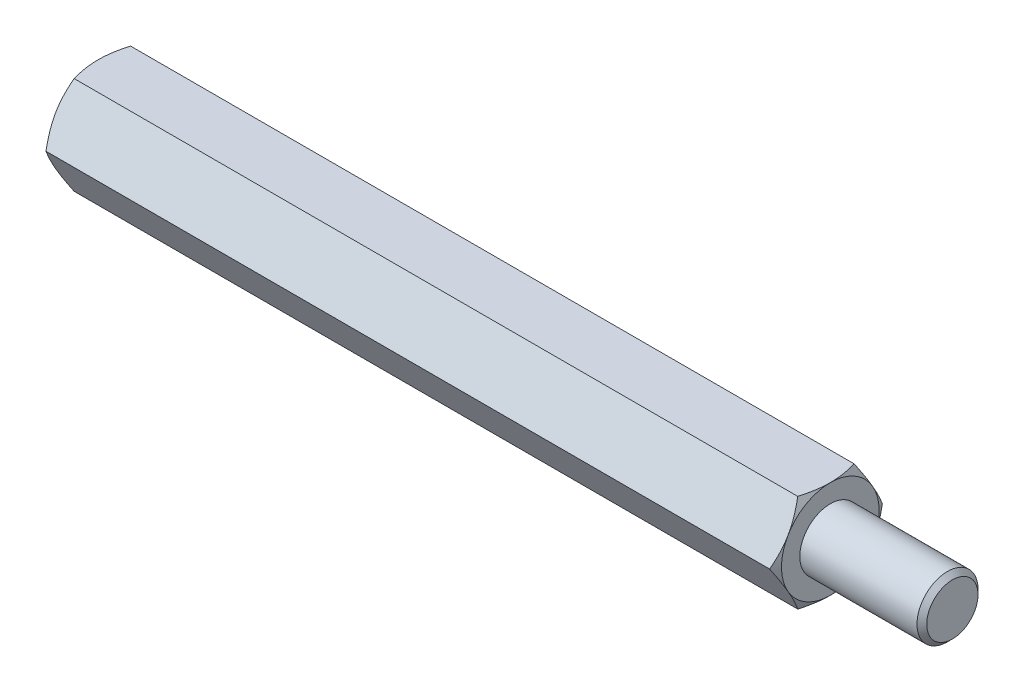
ISO-10303-21;
HEADER;
FILE_DESCRIPTION(('STEP AP214'),'2;1');
FILE_NAME('part.step','',(''),(''),'','','');
FILE_SCHEMA(('AUTOMOTIVE_DESIGN { 1 0 10303 214 1 1 1 1 }'));
ENDSEC;
DATA;
#1=APPLICATION_CONTEXT('core data for automotive mechanical design processes');
#2=APPLICATION_PROTOCOL_DEFINITION('international standard','automotive_design',2000,#1);
#3=PRODUCT_CONTEXT('',#1,'mechanical');
#4=PRODUCT('Part','Part','',(#3));
#5=PRODUCT_RELATED_PRODUCT_CATEGORY('part','',(#4));
#6=PRODUCT_DEFINITION_FORMATION('','',#4);
#7=PRODUCT_DEFINITION_CONTEXT('part definition',#1,'design');
#8=PRODUCT_DEFINITION('design','',#6,#7);
#9=PRODUCT_DEFINITION_SHAPE('','',#8);
#10=(LENGTH_UNIT() NAMED_UNIT(*) SI_UNIT(.MILLI.,.METRE.));
#11=(NAMED_UNIT(*) PLANE_ANGLE_UNIT() SI_UNIT($,.RADIAN.));
#12=(NAMED_UNIT(*) SI_UNIT($,.STERADIAN.) SOLID_ANGLE_UNIT());
#13=UNCERTAINTY_MEASURE_WITH_UNIT(LENGTH_MEASURE(1.E-05),#10,'distance_accuracy_value','');
#14=(GEOMETRIC_REPRESENTATION_CONTEXT(3) GLOBAL_UNCERTAINTY_ASSIGNED_CONTEXT((#13)) GLOBAL_UNIT_ASSIGNED_CONTEXT((#10,
#11,#12)) REPRESENTATION_CONTEXT('',''));
#15=CARTESIAN_POINT('',(0.,0.,0.));
#16=DIRECTION('',(0.,0.,1.));
#17=DIRECTION('',(1.,0.,0.));
#18=AXIS2_PLACEMENT_3D('',#15,#16,#17);
#19=CARTESIAN_POINT('',(30.,4.,-2.3094010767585));
#20=DIRECTION('',(1.,0.,0.));
#21=DIRECTION('',(0.,0.,-1.));
#22=AXIS2_PLACEMENT_3D('',#19,#20,#21);
#23=PLANE('',#22);
#24=CARTESIAN_POINT('',(30.,0.,0.));
#25=DIRECTION('',(1.,0.,0.));
#26=DIRECTION('',(0.,0.,-1.));
#27=AXIS2_PLACEMENT_3D('',#24,#25,#26);
#28=CIRCLE('',#27,4.00000000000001);
#29=CARTESIAN_POINT('',(30.,-2.00000000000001,-3.46410161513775));
#30=VERTEX_POINT('',#29);
#31=CARTESIAN_POINT('',(30.,2.,-3.46410161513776));
#32=VERTEX_POINT('',#31);
#33=EDGE_CURVE('E288',#30,#32,#28,.T.);
#34=ORIENTED_EDGE('',*,*,#33,.T.);
#35=CARTESIAN_POINT('',(30.,4.,0.));
#36=VERTEX_POINT('',#35);
#37=EDGE_CURVE('E53',#32,#36,#28,.T.);
#38=ORIENTED_EDGE('',*,*,#37,.T.);
#39=CARTESIAN_POINT('',(30.,2.,3.46410161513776));
#40=VERTEX_POINT('',#39);
#41=EDGE_CURVE('E296',#36,#40,#28,.T.);
#42=ORIENTED_EDGE('',*,*,#41,.T.);
#43=CARTESIAN_POINT('',(30.,-2.00000000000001,3.46410161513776));
#44=VERTEX_POINT('',#43);
#45=EDGE_CURVE('E301',#40,#44,#28,.T.);
#46=ORIENTED_EDGE('',*,*,#45,.T.);
#47=CARTESIAN_POINT('',(30.,0.,0.));
#48=DIRECTION('',(-1.,0.,0.));
#49=DIRECTION('',(0.,-1.,0.));
#50=AXIS2_PLACEMENT_3D('',#47,#48,#49);
#51=CIRCLE('',#50,4.);
#52=CARTESIAN_POINT('',(30.,-4.00000000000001,0.));
#53=VERTEX_POINT('',#52);
#54=EDGE_CURVE('E193',#53,#44,#51,.T.);
#55=ORIENTED_EDGE('',*,*,#54,.F.);
#56=EDGE_CURVE('E61',#53,#30,#28,.T.);
#57=ORIENTED_EDGE('',*,*,#56,.T.);
#58=EDGE_LOOP('',(#34,#38,#42,#46,#55,#57));
#59=FACE_BOUND('',#58,.T.);
#60=CARTESIAN_POINT('',(30.,0.,0.));
#61=DIRECTION('',(1.,0.,0.));
#62=DIRECTION('',(0.,0.,-1.));
#63=AXIS2_PLACEMENT_3D('',#60,#61,#62);
#64=CIRCLE('',#63,2.5);
#65=CARTESIAN_POINT('',(30.,0.,-2.5));
#66=VERTEX_POINT('',#65);
#67=EDGE_CURVE('E415',#66,#66,#64,.T.);
#68=ORIENTED_EDGE('',*,*,#67,.F.);
#69=EDGE_LOOP('',(#68));
#70=FACE_BOUND('',#69,.T.);
#71=ADVANCED_FACE('F37',(#59,#70),#23,.T.);
#72=CARTESIAN_POINT('',(30.,0.,-4.61880215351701));
#73=DIRECTION('',(0.,-0.5,0.866025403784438));
#74=DIRECTION('',(0.,-0.866025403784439,-0.5));
#75=AXIS2_PLACEMENT_3D('',#72,#73,#74);
#76=PLANE('',#75);
#77=CARTESIAN_POINT('',(29.6426677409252,-0.000200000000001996,-4.61891762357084));
#78=CARTESIAN_POINT('',(29.7012821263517,0.175579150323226,-4.5174314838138));
#79=CARTESIAN_POINT('',(29.7545896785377,0.352875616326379,-4.41506932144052));
#80=CARTESIAN_POINT('',(29.8476383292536,0.710538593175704,-4.20857250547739));
#81=CARTESIAN_POINT('',(29.8873465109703,0.890911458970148,-4.10443418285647));
#82=CARTESIAN_POINT('',(29.9491577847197,1.24942181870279,-3.89744813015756));
#83=CARTESIAN_POINT('',(29.9716722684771,1.42750415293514,-3.79463224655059));
#84=CARTESIAN_POINT('',(29.9985493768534,1.78450671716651,-3.58851671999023));
#85=CARTESIAN_POINT('',(30.0029342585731,1.9634256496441,-3.48521782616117));
#86=CARTESIAN_POINT('',(29.99380992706,2.29774284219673,-3.29219970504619));
#87=CARTESIAN_POINT('',(29.982541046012,2.45319115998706,-3.20245157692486));
#88=CARTESIAN_POINT('',(29.9468260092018,2.76307505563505,-3.02354002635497));
#89=CARTESIAN_POINT('',(29.9223676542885,2.91750956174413,-2.93437722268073));
#90=CARTESIAN_POINT('',(29.8612239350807,3.22803232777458,-2.75509682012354));
#91=CARTESIAN_POINT('',(29.8242793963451,3.3840812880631,-2.6650019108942));
#92=CARTESIAN_POINT('',(29.740429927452,3.69385183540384,-2.48615580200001));
#93=CARTESIAN_POINT('',(29.6935446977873,3.84757739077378,-2.39740231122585));
#94=CARTESIAN_POINT('',(29.6426677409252,4.0002,-2.30928560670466));
#95=B_SPLINE_CURVE_WITH_KNOTS('',3,(#77,#78,#79,#80,#81,#82,#83,#84,#85,#86,#87,#88,#89,#90,#91,
#92,#93,#94),.UNSPECIFIED.,.F.,.F.,(4,2,2,2,2,2,2,2,4),(0.,0.634047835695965,1.26961969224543,
1.88946157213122,2.50854226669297,3.04757825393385,3.58711366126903,4.13861653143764,
4.68903648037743),.UNSPECIFIED.);
#96=CARTESIAN_POINT('',(29.6427344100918,0.,-4.61880215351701));
#97=VERTEX_POINT('',#96);
#98=EDGE_CURVE('E329',#97,#32,#95,.T.);
#99=ORIENTED_EDGE('',*,*,#98,.F.);
#100=DIRECTION('',(-1.,0.,0.));
#101=VECTOR('',#100,1.);
#102=CARTESIAN_POINT('',(30.,0.,-4.61880215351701));
#103=LINE('',#102,#101);
#104=CARTESIAN_POINT('',(-29.6427344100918,0.,-4.61880215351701));
#105=VERTEX_POINT('',#104);
#106=EDGE_CURVE('E264',#97,#105,#103,.T.);
#107=ORIENTED_EDGE('',*,*,#106,.T.);
#108=CARTESIAN_POINT('',(-29.6426677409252,4.0002,-2.30928560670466));
#109=CARTESIAN_POINT('',(-29.7012821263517,3.82442084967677,-2.4107717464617));
#110=CARTESIAN_POINT('',(-29.7545896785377,3.64712438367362,-2.51313390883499));
#111=CARTESIAN_POINT('',(-29.8476383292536,3.28946140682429,-2.71963072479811));
#112=CARTESIAN_POINT('',(-29.8873465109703,3.10908854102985,-2.82376904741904));
#113=CARTESIAN_POINT('',(-29.9491577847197,2.75057818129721,-3.03075510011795));
#114=CARTESIAN_POINT('',(-29.9716722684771,2.57249584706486,-3.13357098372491));
#115=CARTESIAN_POINT('',(-29.9985493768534,2.21549328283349,-3.33968651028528));
#116=CARTESIAN_POINT('',(-30.0029342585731,2.0365743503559,-3.44298540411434));
#117=CARTESIAN_POINT('',(-29.99380992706,1.70225715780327,-3.63600352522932));
#118=CARTESIAN_POINT('',(-29.982541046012,1.54680884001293,-3.72575165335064));
#119=CARTESIAN_POINT('',(-29.9468260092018,1.23692494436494,-3.90466320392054));
#120=CARTESIAN_POINT('',(-29.9223676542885,1.08249043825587,-3.99382600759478));
#121=CARTESIAN_POINT('',(-29.8612239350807,0.771967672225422,-4.17310641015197));
#122=CARTESIAN_POINT('',(-29.8242793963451,0.615918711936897,-4.26320131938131));
#123=CARTESIAN_POINT('',(-29.740429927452,0.306148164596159,-4.4420474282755));
#124=CARTESIAN_POINT('',(-29.6935446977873,0.152422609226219,-4.53080091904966));
#125=CARTESIAN_POINT('',(-29.6426677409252,-0.000200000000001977,-4.61891762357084));
#126=B_SPLINE_CURVE_WITH_KNOTS('',3,(#108,#109,#110,#111,#112,#113,#114,#115,#116,#117,#118,
#119,#120,#121,#122,#123,#124,#125),.UNSPECIFIED.,.F.,.F.,(4,2,2,2,2,2,2,2,4),(0.,
0.634047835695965,1.26961969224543,1.88946157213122,2.50854226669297,3.04757825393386,
3.58711366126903,4.13861653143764,4.68903648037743),.UNSPECIFIED.);
#127=CARTESIAN_POINT('',(-30.,2.,-3.46410161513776));
#128=VERTEX_POINT('',#127);
#129=EDGE_CURVE('E316',#128,#105,#126,.T.);
#130=ORIENTED_EDGE('',*,*,#129,.F.);
#131=CARTESIAN_POINT('',(-29.6427344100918,4.,-2.3094010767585));
#132=VERTEX_POINT('',#131);
#133=EDGE_CURVE('E319',#132,#128,#126,.T.);
#134=ORIENTED_EDGE('',*,*,#133,.F.);
#135=DIRECTION('',(-1.,0.,0.));
#136=VECTOR('',#135,1.);
#137=CARTESIAN_POINT('',(30.,4.,-2.3094010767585));
#138=LINE('',#137,#136);
#139=CARTESIAN_POINT('',(29.642734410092,4.,-2.30940107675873));
#140=VERTEX_POINT('',#139);
#141=EDGE_CURVE('E279',#140,#132,#138,.T.);
#142=ORIENTED_EDGE('',*,*,#141,.F.);
#143=EDGE_CURVE('E229',#32,#140,#95,.T.);
#144=ORIENTED_EDGE('',*,*,#143,.F.);
#145=EDGE_LOOP('',(#99,#107,#130,#134,#142,#144));
#146=FACE_BOUND('',#145,.T.);
#147=ADVANCED_FACE('F148',(#146),#76,.F.);
#148=CARTESIAN_POINT('',(30.,4.,-2.3094010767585));
#149=DIRECTION('',(0.,-1.,0.));
#150=DIRECTION('',(0.,0.,-1.));
#151=AXIS2_PLACEMENT_3D('',#148,#149,#150);
#152=PLANE('',#151);
#153=CARTESIAN_POINT('',(28.0082907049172,4.,-6.28479524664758));
#154=CARTESIAN_POINT('',(28.0937006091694,4.,-6.10939349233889));
#155=CARTESIAN_POINT('',(28.1783148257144,4.,-5.93359774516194));
#156=CARTESIAN_POINT('',(28.3455059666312,4.,-5.58100905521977));
#157=CARTESIAN_POINT('',(28.4280825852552,4.,-5.40421596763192));
#158=CARTESIAN_POINT('',(28.5911508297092,4.,-5.04855089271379));
#159=CARTESIAN_POINT('',(28.6716293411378,4.,-4.86967287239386));
#160=CARTESIAN_POINT('',(28.829400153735,4.,-4.51052237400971));
#161=CARTESIAN_POINT('',(28.906692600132,4.,-4.33024995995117));
#162=CARTESIAN_POINT('',(29.059802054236,4.,-3.96189114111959));
#163=CARTESIAN_POINT('',(29.135480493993,4.,-3.77374683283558));
#164=CARTESIAN_POINT('',(29.2813045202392,4.,-3.39528725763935));
#165=CARTESIAN_POINT('',(29.3514494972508,4.,-3.2049717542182));
#166=CARTESIAN_POINT('',(29.4844245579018,4.,-2.82219775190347));
#167=CARTESIAN_POINT('',(29.5472687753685,4.,-2.62974421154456));
#168=CARTESIAN_POINT('',(29.6636796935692,4.,-2.24207725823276));
#169=CARTESIAN_POINT('',(29.7172492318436,4.,-2.04686470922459));
#170=CARTESIAN_POINT('',(29.8123031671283,4.,-1.65467425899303));
#171=CARTESIAN_POINT('',(29.8538563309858,4.,-1.45771333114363));
#172=CARTESIAN_POINT('',(29.9225903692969,4.,-1.06125849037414));
#173=CARTESIAN_POINT('',(29.9497727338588,4.,-0.861764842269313));
#174=CARTESIAN_POINT('',(29.9872447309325,4.,-0.463879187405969));
#175=CARTESIAN_POINT('',(29.9977578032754,4.,-0.265508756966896));
#176=CARTESIAN_POINT('',(30.0015934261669,4.,0.131417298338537));
#177=CARTESIAN_POINT('',(29.9949158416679,4.,0.329972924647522));
#178=CARTESIAN_POINT('',(29.9696489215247,4.,0.664692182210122));
#179=CARTESIAN_POINT('',(29.9553708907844,4.,0.801202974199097));
#180=CARTESIAN_POINT('',(29.9195349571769,4.,1.07327201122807));
#181=CARTESIAN_POINT('',(29.8979761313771,4.,1.20883013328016));
#182=CARTESIAN_POINT('',(29.8235066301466,4.,1.61386939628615));
#183=CARTESIAN_POINT('',(29.7608149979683,4.,1.88157484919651));
#184=CARTESIAN_POINT('',(29.6515117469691,4.,2.28197262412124));
#185=CARTESIAN_POINT('',(29.612009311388,4.,2.41672443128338));
#186=CARTESIAN_POINT('',(29.5287523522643,4.,2.68492067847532));
#187=CARTESIAN_POINT('',(29.4849977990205,4.,2.81836510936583));
#188=CARTESIAN_POINT('',(29.3939510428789,4.,3.08398596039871));
#189=CARTESIAN_POINT('',(29.346659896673,4.,3.21616274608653));
#190=CARTESIAN_POINT('',(29.2491111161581,4.,3.47941134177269));
#191=CARTESIAN_POINT('',(29.1988535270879,4.,3.61048316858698));
#192=CARTESIAN_POINT('',(29.0713295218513,4.,3.93385125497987));
#193=CARTESIAN_POINT('',(28.9926014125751,4.,4.12557021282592));
#194=CARTESIAN_POINT('',(28.8309693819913,4.,4.50724553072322));
#195=CARTESIAN_POINT('',(28.7480651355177,4.,4.69720175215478));
#196=CARTESIAN_POINT('',(28.5789699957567,4.,5.07569950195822));
#197=CARTESIAN_POINT('',(28.4927782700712,4.,5.26424065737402));
#198=CARTESIAN_POINT('',(28.3178011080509,4.,5.64011758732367));
#199=CARTESIAN_POINT('',(28.2290156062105,4.,5.82745333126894));
#200=CARTESIAN_POINT('',(27.9593432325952,4.,6.38844423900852));
#201=CARTESIAN_POINT('',(27.7753561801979,4.,6.76060781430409));
#202=CARTESIAN_POINT('',(27.4019562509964,4.,7.50211228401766));
#203=CARTESIAN_POINT('',(27.2125442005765,4.,7.87145359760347));
#204=CARTESIAN_POINT('',(26.8473877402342,4.,8.57450173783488));
#205=CARTESIAN_POINT('',(26.671975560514,4.,8.90838144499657));
#206=CARTESIAN_POINT('',(26.3188097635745,4.,9.57491712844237));
#207=CARTESIAN_POINT('',(26.1410560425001,4.,9.90757304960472));
#208=CARTESIAN_POINT('',(25.7842933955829,4.,10.5709822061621));
#209=CARTESIAN_POINT('',(25.6052895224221,3.99999999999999,10.9017381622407));
#210=CARTESIAN_POINT('',(25.2459071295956,3.99999999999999,11.5624752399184));
#211=CARTESIAN_POINT('',(25.0655286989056,3.99999999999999,11.8924564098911));
#212=CARTESIAN_POINT('',(24.884642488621,3.99999999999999,12.2221569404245));
#213=B_SPLINE_CURVE_WITH_KNOTS('',3,(#153,#154,#155,#156,#157,#158,#159,#160,#161,#162,#163,
#164,#165,#166,#167,#168,#169,#170,#171,#172,#173,#174,#175,#176,#177,#178,#179,#180,#181,#182,
#183,#184,#185,#186,#187,#188,#189,#190,#191,#192,#193,#194,#195,#196,#197,#198,#199,#200,#201,
#202,#203,#204,#205,#206,#207,#208,#209,#210,#211,#212),.UNSPECIFIED.,.F.,.F.,(4,2,2,2,2,2,2,2,
2,2,2,2,2,2,2,2,2,2,2,2,2,2,2,2,2,2,2,2,2,4),(0.,0.585280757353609,1.17064881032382,
1.75906864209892,2.34746162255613,2.9557770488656,3.56415938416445,4.17134357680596,
4.77834167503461,5.38179402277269,5.98518378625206,6.58041501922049,7.17565092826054,
7.5872191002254,7.99883946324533,8.82250155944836,9.24373134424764,9.6649640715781,
10.086071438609,10.5071723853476,11.1288656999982,11.7506074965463,12.3725077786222,
12.9944237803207,14.2398211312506,15.4850297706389,16.6164791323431,17.7479788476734,
18.8762380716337,20.0044248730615),.UNSPECIFIED.);
#214=EDGE_CURVE('E227',#140,#36,#213,.T.);
#215=ORIENTED_EDGE('',*,*,#214,.F.);
#216=ORIENTED_EDGE('',*,*,#141,.T.);
#217=CARTESIAN_POINT('',(-28.0082907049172,4.,-6.28479524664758));
#218=CARTESIAN_POINT('',(-28.0937006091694,4.,-6.10939349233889));
#219=CARTESIAN_POINT('',(-28.1783148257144,4.,-5.93359774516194));
#220=CARTESIAN_POINT('',(-28.3455059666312,4.,-5.58100905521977));
#221=CARTESIAN_POINT('',(-28.4280825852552,4.,-5.40421596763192));
#222=CARTESIAN_POINT('',(-28.5911508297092,4.,-5.04855089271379));
#223=CARTESIAN_POINT('',(-28.6716293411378,4.,-4.86967287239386));
#224=CARTESIAN_POINT('',(-28.829400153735,4.,-4.51052237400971));
#225=CARTESIAN_POINT('',(-28.906692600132,4.,-4.33024995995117));
#226=CARTESIAN_POINT('',(-29.059802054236,4.,-3.96189114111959));
#227=CARTESIAN_POINT('',(-29.135480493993,4.,-3.77374683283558));
#228=CARTESIAN_POINT('',(-29.2813045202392,4.,-3.39528725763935));
#229=CARTESIAN_POINT('',(-29.3514494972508,4.,-3.2049717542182));
#230=CARTESIAN_POINT('',(-29.4844245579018,4.,-2.82219775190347));
#231=CARTESIAN_POINT('',(-29.5472687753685,4.,-2.62974421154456));
#232=CARTESIAN_POINT('',(-29.6636796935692,4.,-2.24207725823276));
#233=CARTESIAN_POINT('',(-29.7172492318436,4.,-2.04686470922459));
#234=CARTESIAN_POINT('',(-29.8123031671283,4.,-1.65467425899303));
#235=CARTESIAN_POINT('',(-29.8538563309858,4.,-1.45771333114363));
#236=CARTESIAN_POINT('',(-29.9225903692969,4.,-1.06125849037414));
#237=CARTESIAN_POINT('',(-29.9497727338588,4.,-0.861764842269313));
#238=CARTESIAN_POINT('',(-29.9872447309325,4.,-0.463879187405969));
#239=CARTESIAN_POINT('',(-29.9977578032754,4.,-0.265508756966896));
#240=CARTESIAN_POINT('',(-30.0015934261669,4.,0.131417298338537));
#241=CARTESIAN_POINT('',(-29.9949158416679,4.,0.329972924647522));
#242=CARTESIAN_POINT('',(-29.9696489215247,4.,0.664692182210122));
#243=CARTESIAN_POINT('',(-29.9553708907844,4.,0.801202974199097));
#244=CARTESIAN_POINT('',(-29.9195349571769,4.,1.07327201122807));
#245=CARTESIAN_POINT('',(-29.8979761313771,4.,1.20883013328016));
#246=CARTESIAN_POINT('',(-29.8235066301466,4.,1.61386939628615));
#247=CARTESIAN_POINT('',(-29.7608149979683,4.,1.88157484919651));
#248=CARTESIAN_POINT('',(-29.6515117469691,4.,2.28197262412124));
#249=CARTESIAN_POINT('',(-29.612009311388,4.,2.41672443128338));
#250=CARTESIAN_POINT('',(-29.5287523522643,4.,2.68492067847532));
#251=CARTESIAN_POINT('',(-29.4849977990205,4.,2.81836510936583));
#252=CARTESIAN_POINT('',(-29.3939510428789,4.,3.08398596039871));
#253=CARTESIAN_POINT('',(-29.346659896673,4.,3.21616274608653));
#254=CARTESIAN_POINT('',(-29.2491111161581,4.,3.47941134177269));
#255=CARTESIAN_POINT('',(-29.1988535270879,4.,3.61048316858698));
#256=CARTESIAN_POINT('',(-29.0713295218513,4.,3.93385125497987));
#257=CARTESIAN_POINT('',(-28.9926014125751,4.,4.12557021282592));
#258=CARTESIAN_POINT('',(-28.8309693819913,4.,4.50724553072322));
#259=CARTESIAN_POINT('',(-28.7480651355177,4.,4.69720175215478));
#260=CARTESIAN_POINT('',(-28.5789699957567,4.,5.07569950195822));
#261=CARTESIAN_POINT('',(-28.4927782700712,4.,5.26424065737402));
#262=CARTESIAN_POINT('',(-28.3178011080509,4.,5.64011758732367));
#263=CARTESIAN_POINT('',(-28.2290156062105,4.,5.82745333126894));
#264=CARTESIAN_POINT('',(-27.9593432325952,4.,6.38844423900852));
#265=CARTESIAN_POINT('',(-27.7753561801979,4.,6.76060781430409));
#266=CARTESIAN_POINT('',(-27.4019562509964,4.,7.50211228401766));
#267=CARTESIAN_POINT('',(-27.2125442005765,4.,7.87145359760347));
#268=CARTESIAN_POINT('',(-26.8473877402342,4.,8.57450173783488));
#269=CARTESIAN_POINT('',(-26.671975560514,4.,8.90838144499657));
#270=CARTESIAN_POINT('',(-26.3188097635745,4.,9.57491712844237));
#271=CARTESIAN_POINT('',(-26.1410560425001,4.,9.90757304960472));
#272=CARTESIAN_POINT('',(-25.7842933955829,4.,10.5709822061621));
#273=CARTESIAN_POINT('',(-25.6052895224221,3.99999999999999,10.9017381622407));
#274=CARTESIAN_POINT('',(-25.2459071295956,3.99999999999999,11.5624752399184));
#275=CARTESIAN_POINT('',(-25.0655286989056,3.99999999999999,11.8924564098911));
#276=CARTESIAN_POINT('',(-24.884642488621,3.99999999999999,12.2221569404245));
#277=B_SPLINE_CURVE_WITH_KNOTS('',3,(#217,#218,#219,#220,#221,#222,#223,#224,#225,#226,#227,
#228,#229,#230,#231,#232,#233,#234,#235,#236,#237,#238,#239,#240,#241,#242,#243,#244,#245,#246,
#247,#248,#249,#250,#251,#252,#253,#254,#255,#256,#257,#258,#259,#260,#261,#262,#263,#264,#265,
#266,#267,#268,#269,#270,#271,#272,#273,#274,#275,#276),.UNSPECIFIED.,.F.,.F.,(4,2,2,2,2,2,2,2,
2,2,2,2,2,2,2,2,2,2,2,2,2,2,2,2,2,2,2,2,2,4),(0.,0.585280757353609,1.17064881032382,
1.75906864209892,2.34746162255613,2.9557770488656,3.56415938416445,4.17134357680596,
4.77834167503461,5.38179402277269,5.98518378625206,6.58041501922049,7.17565092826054,
7.5872191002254,7.99883946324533,8.82250155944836,9.24373134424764,9.6649640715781,
10.086071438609,10.5071723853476,11.1288656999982,11.7506074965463,12.3725077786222,
12.9944237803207,14.2398211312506,15.4850297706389,16.6164791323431,17.7479788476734,
18.8762380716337,20.0044248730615),.UNSPECIFIED.);
#278=CARTESIAN_POINT('',(-30.,4.,0.));
#279=VERTEX_POINT('',#278);
#280=EDGE_CURVE('E241',#279,#132,#277,.F.);
#281=ORIENTED_EDGE('',*,*,#280,.F.);
#282=CARTESIAN_POINT('',(-29.6427344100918,4.,2.3094010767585));
#283=VERTEX_POINT('',#282);
#284=EDGE_CURVE('E249',#283,#279,#277,.F.);
#285=ORIENTED_EDGE('',*,*,#284,.F.);
#286=DIRECTION('',(-1.,0.,0.));
#287=VECTOR('',#286,1.);
#288=CARTESIAN_POINT('',(30.,4.,2.3094010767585));
#289=LINE('',#288,#287);
#290=CARTESIAN_POINT('',(29.6427344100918,4.,2.3094010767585));
#291=VERTEX_POINT('',#290);
#292=EDGE_CURVE('E276',#291,#283,#289,.T.);
#293=ORIENTED_EDGE('',*,*,#292,.F.);
#294=EDGE_CURVE('E221',#36,#291,#213,.T.);
#295=ORIENTED_EDGE('',*,*,#294,.F.);
#296=EDGE_LOOP('',(#215,#216,#281,#285,#293,#295));
#297=FACE_BOUND('',#296,.T.);
#298=ADVANCED_FACE('F153',(#297),#152,.F.);
#299=CARTESIAN_POINT('',(30.,4.,2.3094010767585));
#300=DIRECTION('',(0.,-0.5,-0.866025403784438));
#301=DIRECTION('',(0.,0.866025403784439,-0.5));
#302=AXIS2_PLACEMENT_3D('',#299,#300,#301);
#303=PLANE('',#302);
#304=CARTESIAN_POINT('',(29.6426677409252,4.0002,2.30928560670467));
#305=CARTESIAN_POINT('',(29.7012821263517,3.82442084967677,2.4107717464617));
#306=CARTESIAN_POINT('',(29.7545896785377,3.64712438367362,2.51313390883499));
#307=CARTESIAN_POINT('',(29.8476383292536,3.28946140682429,2.71963072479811));
#308=CARTESIAN_POINT('',(29.8873465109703,3.10908854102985,2.82376904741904));
#309=CARTESIAN_POINT('',(29.9491577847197,2.75057818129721,3.03075510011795));
#310=CARTESIAN_POINT('',(29.9716722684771,2.57249584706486,3.13357098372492));
#311=CARTESIAN_POINT('',(29.9985493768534,2.21549328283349,3.33968651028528));
#312=CARTESIAN_POINT('',(30.0029342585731,2.0365743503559,3.44298540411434));
#313=CARTESIAN_POINT('',(29.99380992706,1.70225715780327,3.63600352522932));
#314=CARTESIAN_POINT('',(29.982541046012,1.54680884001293,3.72575165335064));
#315=CARTESIAN_POINT('',(29.9468260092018,1.23692494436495,3.90466320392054));
#316=CARTESIAN_POINT('',(29.9223676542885,1.08249043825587,3.99382600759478));
#317=CARTESIAN_POINT('',(29.8612239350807,0.771967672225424,4.17310641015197));
#318=CARTESIAN_POINT('',(29.8242793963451,0.615918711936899,4.26320131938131));
#319=CARTESIAN_POINT('',(29.740429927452,0.306148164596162,4.4420474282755));
#320=CARTESIAN_POINT('',(29.6935446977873,0.152422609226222,4.53080091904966));
#321=CARTESIAN_POINT('',(29.6426677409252,-0.000199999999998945,4.61891762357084));
#322=B_SPLINE_CURVE_WITH_KNOTS('',3,(#304,#305,#306,#307,#308,#309,#310,#311,#312,#313,#314,
#315,#316,#317,#318,#319,#320,#321),.UNSPECIFIED.,.F.,.F.,(4,2,2,2,2,2,2,2,4),(0.,
0.634047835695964,1.26961969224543,1.88946157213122,2.50854226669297,3.04757825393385,
3.58711366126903,4.13861653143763,4.68903648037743),.UNSPECIFIED.);
#323=EDGE_CURVE('E228',#291,#40,#322,.T.);
#324=ORIENTED_EDGE('',*,*,#323,.F.);
#325=ORIENTED_EDGE('',*,*,#292,.T.);
#326=CARTESIAN_POINT('',(-29.6426677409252,-0.000199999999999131,4.61891762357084));
#327=CARTESIAN_POINT('',(-29.7012821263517,0.175579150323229,4.5174314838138));
#328=CARTESIAN_POINT('',(-29.7545896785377,0.352875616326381,4.41506932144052));
#329=CARTESIAN_POINT('',(-29.8476383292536,0.710538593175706,4.20857250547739));
#330=CARTESIAN_POINT('',(-29.8873465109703,0.89091145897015,4.10443418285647));
#331=CARTESIAN_POINT('',(-29.9491577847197,1.24942181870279,3.89744813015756));
#332=CARTESIAN_POINT('',(-29.9716722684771,1.42750415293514,3.79463224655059));
#333=CARTESIAN_POINT('',(-29.9985493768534,1.78450671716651,3.58851671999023));
#334=CARTESIAN_POINT('',(-30.0029342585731,1.9634256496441,3.48521782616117));
#335=CARTESIAN_POINT('',(-29.99380992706,2.29774284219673,3.29219970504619));
#336=CARTESIAN_POINT('',(-29.982541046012,2.45319115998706,3.20245157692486));
#337=CARTESIAN_POINT('',(-29.9468260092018,2.76307505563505,3.02354002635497));
#338=CARTESIAN_POINT('',(-29.9223676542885,2.91750956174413,2.93437722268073));
#339=CARTESIAN_POINT('',(-29.8612239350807,3.22803232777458,2.75509682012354));
#340=CARTESIAN_POINT('',(-29.8242793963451,3.3840812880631,2.6650019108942));
#341=CARTESIAN_POINT('',(-29.740429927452,3.69385183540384,2.48615580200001));
#342=CARTESIAN_POINT('',(-29.6935446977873,3.84757739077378,2.39740231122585));
#343=CARTESIAN_POINT('',(-29.6426677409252,4.0002,2.30928560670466));
#344=B_SPLINE_CURVE_WITH_KNOTS('',3,(#326,#327,#328,#329,#330,#331,#332,#333,#334,#335,#336,
#337,#338,#339,#340,#341,#342,#343),.UNSPECIFIED.,.F.,.F.,(4,2,2,2,2,2,2,2,4),(0.,
0.634047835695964,1.26961969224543,1.88946157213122,2.50854226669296,3.04757825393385,
3.58711366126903,4.13861653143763,4.68903648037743),.UNSPECIFIED.);
#345=CARTESIAN_POINT('',(-30.,2.,3.46410161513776));
#346=VERTEX_POINT('',#345);
#347=EDGE_CURVE('E255',#346,#283,#344,.T.);
#348=ORIENTED_EDGE('',*,*,#347,.F.);
#349=CARTESIAN_POINT('',(-29.6427344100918,0.,4.618802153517));
#350=VERTEX_POINT('',#349);
#351=EDGE_CURVE('E262',#350,#346,#344,.T.);
#352=ORIENTED_EDGE('',*,*,#351,.F.);
#353=DIRECTION('',(-1.,0.,0.));
#354=VECTOR('',#353,1.);
#355=CARTESIAN_POINT('',(30.,0.,4.618802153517));
#356=LINE('',#355,#354);
#357=CARTESIAN_POINT('',(29.6427344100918,0.,4.618802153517));
#358=VERTEX_POINT('',#357);
#359=EDGE_CURVE('E273',#358,#350,#356,.T.);
#360=ORIENTED_EDGE('',*,*,#359,.F.);
#361=EDGE_CURVE('E215',#40,#358,#322,.T.);
#362=ORIENTED_EDGE('',*,*,#361,.F.);
#363=EDGE_LOOP('',(#324,#325,#348,#352,#360,#362));
#364=FACE_BOUND('',#363,.T.);
#365=ADVANCED_FACE('F235',(#364),#303,.F.);
#366=CARTESIAN_POINT('',(30.,0.,4.618802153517));
#367=DIRECTION('',(0.,0.5,-0.866025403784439));
#368=DIRECTION('',(0.,0.866025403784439,0.5));
#369=AXIS2_PLACEMENT_3D('',#366,#367,#368);
#370=PLANE('',#369);
#371=CARTESIAN_POINT('',(29.6426677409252,0.000200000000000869,4.61891762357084));
#372=CARTESIAN_POINT('',(29.7012821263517,-0.175579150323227,4.5174314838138));
#373=CARTESIAN_POINT('',(29.7545896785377,-0.352875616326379,4.41506932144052));
#374=CARTESIAN_POINT('',(29.8476383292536,-0.710538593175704,4.20857250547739));
#375=CARTESIAN_POINT('',(29.8873465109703,-0.890911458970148,4.10443418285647));
#376=CARTESIAN_POINT('',(29.9491577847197,-1.24942181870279,3.89744813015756));
#377=CARTESIAN_POINT('',(29.9716722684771,-1.42750415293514,3.79463224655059));
#378=CARTESIAN_POINT('',(29.9985493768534,-1.7845067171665,3.58851671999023));
#379=CARTESIAN_POINT('',(30.0029342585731,-1.96342564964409,3.48521782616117));
#380=CARTESIAN_POINT('',(29.99380992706,-2.29774284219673,3.29219970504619));
#381=CARTESIAN_POINT('',(29.982541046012,-2.45319115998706,3.20245157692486));
#382=CARTESIAN_POINT('',(29.9468260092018,-2.76307505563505,3.02354002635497));
#383=CARTESIAN_POINT('',(29.9223676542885,-2.91750956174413,2.93437722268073));
#384=CARTESIAN_POINT('',(29.8612239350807,-3.22803232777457,2.75509682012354));
#385=CARTESIAN_POINT('',(29.8242793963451,-3.3840812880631,2.6650019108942));
#386=CARTESIAN_POINT('',(29.740429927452,-3.69385183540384,2.48615580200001));
#387=CARTESIAN_POINT('',(29.6935446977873,-3.84757739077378,2.39740231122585));
#388=CARTESIAN_POINT('',(29.6426677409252,-4.0002,2.30928560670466));
#389=B_SPLINE_CURVE_WITH_KNOTS('',3,(#371,#372,#373,#374,#375,#376,#377,#378,#379,#380,#381,
#382,#383,#384,#385,#386,#387,#388),.UNSPECIFIED.,.F.,.F.,(4,2,2,2,2,2,2,2,4),(0.,
0.634047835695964,1.26961969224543,1.88946157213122,2.50854226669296,3.04757825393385,
3.58711366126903,4.13861653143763,4.68903648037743),.UNSPECIFIED.);
#390=EDGE_CURVE('E405',#358,#44,#389,.T.);
#391=ORIENTED_EDGE('',*,*,#390,.F.);
#392=ORIENTED_EDGE('',*,*,#359,.T.);
#393=CARTESIAN_POINT('',(-29.6426677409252,-4.0002,2.30928560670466));
#394=CARTESIAN_POINT('',(-29.7012821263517,-3.82442084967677,2.4107717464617));
#395=CARTESIAN_POINT('',(-29.7545896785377,-3.64712438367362,2.51313390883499));
#396=CARTESIAN_POINT('',(-29.8476383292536,-3.2894614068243,2.71963072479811));
#397=CARTESIAN_POINT('',(-29.8873465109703,-3.10908854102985,2.82376904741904));
#398=CARTESIAN_POINT('',(-29.9491577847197,-2.75057818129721,3.03075510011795));
#399=CARTESIAN_POINT('',(-29.9716722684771,-2.57249584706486,3.13357098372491));
#400=CARTESIAN_POINT('',(-29.9985493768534,-2.2154932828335,3.33968651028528));
#401=CARTESIAN_POINT('',(-30.0029342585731,-2.0365743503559,3.44298540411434));
#402=CARTESIAN_POINT('',(-29.99380992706,-1.70225715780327,3.63600352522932));
#403=CARTESIAN_POINT('',(-29.982541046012,-1.54680884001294,3.72575165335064));
#404=CARTESIAN_POINT('',(-29.9468260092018,-1.23692494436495,3.90466320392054));
#405=CARTESIAN_POINT('',(-29.9223676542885,-1.08249043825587,3.99382600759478));
#406=CARTESIAN_POINT('',(-29.8612239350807,-0.771967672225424,4.17310641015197));
#407=CARTESIAN_POINT('',(-29.8242793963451,-0.615918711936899,4.26320131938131));
#408=CARTESIAN_POINT('',(-29.740429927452,-0.306148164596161,4.4420474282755));
#409=CARTESIAN_POINT('',(-29.6935446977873,-0.152422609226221,4.53080091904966));
#410=CARTESIAN_POINT('',(-29.6426677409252,0.000200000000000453,4.61891762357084));
#411=B_SPLINE_CURVE_WITH_KNOTS('',3,(#393,#394,#395,#396,#397,#398,#399,#400,#401,#402,#403,
#404,#405,#406,#407,#408,#409,#410),.UNSPECIFIED.,.F.,.F.,(4,2,2,2,2,2,2,2,4),(0.,
0.634047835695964,1.26961969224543,1.88946157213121,2.50854226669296,3.04757825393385,
3.58711366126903,4.13861653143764,4.68903648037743),.UNSPECIFIED.);
#412=CARTESIAN_POINT('',(-30.,-2.00000000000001,3.46410161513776));
#413=VERTEX_POINT('',#412);
#414=EDGE_CURVE('E263',#413,#350,#411,.T.);
#415=ORIENTED_EDGE('',*,*,#414,.F.);
#416=CARTESIAN_POINT('',(-29.6427344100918,-4.,2.3094010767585));
#417=VERTEX_POINT('',#416);
#418=EDGE_CURVE('E250',#417,#413,#411,.T.);
#419=ORIENTED_EDGE('',*,*,#418,.F.);
#420=DIRECTION('',(-1.,0.,0.));
#421=VECTOR('',#420,1.);
#422=CARTESIAN_POINT('',(30.,-4.,2.3094010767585));
#423=LINE('',#422,#421);
#424=CARTESIAN_POINT('',(29.6427344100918,-4.,2.3094010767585));
#425=VERTEX_POINT('',#424);
#426=EDGE_CURVE('E270',#425,#417,#423,.T.);
#427=ORIENTED_EDGE('',*,*,#426,.F.);
#428=EDGE_CURVE('E210',#44,#425,#389,.T.);
#429=ORIENTED_EDGE('',*,*,#428,.F.);
#430=EDGE_LOOP('',(#391,#392,#415,#419,#427,#429));
#431=FACE_BOUND('',#430,.T.);
#432=ADVANCED_FACE('F385',(#431),#370,.F.);
#433=CARTESIAN_POINT('',(30.,-4.,2.3094010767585));
#434=DIRECTION('',(0.,1.,0.));
#435=DIRECTION('',(0.,0.,1.));
#436=AXIS2_PLACEMENT_3D('',#433,#434,#435);
#437=PLANE('',#436);
#438=CARTESIAN_POINT('',(28.0082907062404,-4.,-6.28479524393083));
#439=CARTESIAN_POINT('',(28.0937006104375,-4.,-6.10939348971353));
#440=CARTESIAN_POINT('',(28.1783148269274,-4.,-5.93359774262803));
#441=CARTESIAN_POINT('',(28.3455059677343,-4.,-5.58100905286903));
#442=CARTESIAN_POINT('',(28.4280825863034,-4.,-5.40421596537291));
#443=CARTESIAN_POINT('',(28.5911508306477,-4.,-5.04855089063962));
#444=CARTESIAN_POINT('',(28.6716293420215,-4.,-4.8696728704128));
#445=CARTESIAN_POINT('',(28.8294001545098,-4.,-4.51052237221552));
#446=CARTESIAN_POINT('',(28.9066926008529,-4.,-4.33024995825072));
#447=CARTESIAN_POINT('',(29.0598020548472,-4.,-3.96189113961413));
#448=CARTESIAN_POINT('',(29.1354804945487,-4.,-3.77374683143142));
#449=CARTESIAN_POINT('',(29.2813045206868,-4.,-3.39528725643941));
#450=CARTESIAN_POINT('',(29.3514494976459,-4.,-3.20497175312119));
#451=CARTESIAN_POINT('',(29.4844245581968,-4.,-2.82219775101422));
#452=CARTESIAN_POINT('',(29.5472687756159,-4.,-2.62974421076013));
#453=CARTESIAN_POINT('',(29.6636796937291,-4.,-2.24207725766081));
#454=CARTESIAN_POINT('',(29.7172492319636,-4.,-2.04686470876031));
#455=CARTESIAN_POINT('',(29.8123031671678,-4.,-1.65467425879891));
#456=CARTESIAN_POINT('',(29.8538563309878,-4.,-1.45771333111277));
#457=CARTESIAN_POINT('',(29.9225903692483,-4.,-1.06125849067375));
#458=CARTESIAN_POINT('',(29.9497727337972,-4.,-0.861764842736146));
#459=CARTESIAN_POINT('',(29.9872447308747,-4.,-0.463879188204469));
#460=CARTESIAN_POINT('',(29.9977578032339,-4.,-0.265508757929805));
#461=CARTESIAN_POINT('',(30.0015934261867,-4.,0.131417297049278));
#462=CARTESIAN_POINT('',(29.9949158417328,-4.,0.329972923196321));
#463=CARTESIAN_POINT('',(29.9696489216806,-4.,0.664692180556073));
#464=CARTESIAN_POINT('',(29.9553708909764,-4.,0.801202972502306));
#465=CARTESIAN_POINT('',(29.9195349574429,-4.,1.07327200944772));
#466=CARTESIAN_POINT('',(29.8979761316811,-4.,1.20883013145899));
#467=CARTESIAN_POINT('',(29.8235066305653,-4.,1.6138693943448));
#468=CARTESIAN_POINT('',(29.7608149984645,-4.,1.88157484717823));
#469=CARTESIAN_POINT('',(29.6515117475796,-4.,2.28197262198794));
#470=CARTESIAN_POINT('',(29.6120093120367,-4.,2.41672442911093));
#471=CARTESIAN_POINT('',(29.5287523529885,-4.,2.68492067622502));
#472=CARTESIAN_POINT('',(29.4849977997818,-4.,2.81836510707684));
#473=CARTESIAN_POINT('',(29.3939510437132,-4.,3.0839859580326));
#474=CARTESIAN_POINT('',(29.3466598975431,-4.,3.21616274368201));
#475=CARTESIAN_POINT('',(29.2491111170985,-4.,3.47941133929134));
#476=CARTESIAN_POINT('',(29.1988535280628,-4.,3.61048316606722));
#477=CARTESIAN_POINT('',(29.0713295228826,-4.,3.93385125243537));
#478=CARTESIAN_POINT('',(28.9926014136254,-4.,4.12557021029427));
#479=CARTESIAN_POINT('',(28.830969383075,-4.,4.50724552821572));
#480=CARTESIAN_POINT('',(28.7480651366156,-4.,4.69720174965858));
#481=CARTESIAN_POINT('',(28.5789699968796,-4.,5.07569949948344));
#482=CARTESIAN_POINT('',(28.4927782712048,-4.,5.26424065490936));
#483=CARTESIAN_POINT('',(28.3178011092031,-4.,5.64011758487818));
#484=CARTESIAN_POINT('',(28.2290156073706,-4.,5.8274533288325));
#485=CARTESIAN_POINT('',(27.9593432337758,-4.,6.38844423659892));
#486=CARTESIAN_POINT('',(27.775356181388,-4.,6.76060781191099));
#487=CARTESIAN_POINT('',(27.4019562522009,-4.,7.50211228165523));
#488=CARTESIAN_POINT('',(27.2125442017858,-4.,7.8714535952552));
#489=CARTESIAN_POINT('',(26.8473877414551,-4.,8.57450173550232));
#490=CARTESIAN_POINT('',(26.671975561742,-4.,8.90838144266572));
#491=CARTESIAN_POINT('',(26.3188097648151,-4.,9.57491712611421));
#492=CARTESIAN_POINT('',(26.1410560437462,-4.,9.90757304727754));
#493=CARTESIAN_POINT('',(25.78429339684,-4.,10.5709822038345));
#494=CARTESIAN_POINT('',(25.6052895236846,-4.,10.9017381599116));
#495=CARTESIAN_POINT('',(25.2459071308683,-4.,11.562475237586));
#496=CARTESIAN_POINT('',(25.065528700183,-4.,11.8924564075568));
#497=CARTESIAN_POINT('',(24.884642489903,-4.,12.2221569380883));
#498=B_SPLINE_CURVE_WITH_KNOTS('',3,(#438,#439,#440,#441,#442,#443,#444,#445,#446,#447,#448,
#449,#450,#451,#452,#453,#454,#455,#456,#457,#458,#459,#460,#461,#462,#463,#464,#465,#466,#467,
#468,#469,#470,#471,#472,#473,#474,#475,#476,#477,#478,#479,#480,#481,#482,#483,#484,#485,#486,
#487,#488,#489,#490,#491,#492,#493,#494,#495,#496,#497),.UNSPECIFIED.,.F.,.F.,(4,2,2,2,2,2,2,2,
2,2,2,2,2,2,2,2,2,2,2,2,2,2,2,2,2,2,2,2,2,4),(0.,0.585280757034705,1.17064880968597,
1.75906864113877,2.34746162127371,2.95577704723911,3.56415938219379,4.17134357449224,
4.77834167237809,5.38179401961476,5.98518378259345,6.58041501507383,7.17565092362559,
7.58721909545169,7.99883945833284,8.82250155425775,9.24373133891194,9.66496406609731,
10.0860714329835,10.5071723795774,11.1288656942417,11.7506074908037,12.3725077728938,
12.9944237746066,14.2398211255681,15.4850297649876,16.6164791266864,17.7479788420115,
18.8762380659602,20.0044248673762),.UNSPECIFIED.);
#499=EDGE_CURVE('E326',#425,#53,#498,.F.);
#500=ORIENTED_EDGE('',*,*,#499,.F.);
#501=ORIENTED_EDGE('',*,*,#426,.T.);
#502=CARTESIAN_POINT('',(-28.0082907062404,-4.,-6.28479524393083));
#503=CARTESIAN_POINT('',(-28.0937006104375,-4.,-6.10939348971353));
#504=CARTESIAN_POINT('',(-28.1783148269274,-4.,-5.93359774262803));
#505=CARTESIAN_POINT('',(-28.3455059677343,-4.,-5.58100905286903));
#506=CARTESIAN_POINT('',(-28.4280825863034,-4.,-5.40421596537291));
#507=CARTESIAN_POINT('',(-28.5911508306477,-4.,-5.04855089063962));
#508=CARTESIAN_POINT('',(-28.6716293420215,-4.,-4.8696728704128));
#509=CARTESIAN_POINT('',(-28.8294001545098,-4.,-4.51052237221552));
#510=CARTESIAN_POINT('',(-28.9066926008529,-4.,-4.33024995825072));
#511=CARTESIAN_POINT('',(-29.0598020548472,-4.,-3.96189113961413));
#512=CARTESIAN_POINT('',(-29.1354804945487,-4.,-3.77374683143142));
#513=CARTESIAN_POINT('',(-29.2813045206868,-4.,-3.39528725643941));
#514=CARTESIAN_POINT('',(-29.3514494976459,-4.,-3.20497175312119));
#515=CARTESIAN_POINT('',(-29.4844245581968,-4.,-2.82219775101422));
#516=CARTESIAN_POINT('',(-29.5472687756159,-4.,-2.62974421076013));
#517=CARTESIAN_POINT('',(-29.6636796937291,-4.,-2.24207725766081));
#518=CARTESIAN_POINT('',(-29.7172492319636,-4.,-2.04686470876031));
#519=CARTESIAN_POINT('',(-29.8123031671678,-4.,-1.65467425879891));
#520=CARTESIAN_POINT('',(-29.8538563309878,-4.,-1.45771333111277));
#521=CARTESIAN_POINT('',(-29.9225903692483,-4.,-1.06125849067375));
#522=CARTESIAN_POINT('',(-29.9497727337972,-4.,-0.861764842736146));
#523=CARTESIAN_POINT('',(-29.9872447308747,-4.,-0.463879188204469));
#524=CARTESIAN_POINT('',(-29.9977578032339,-4.,-0.265508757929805));
#525=CARTESIAN_POINT('',(-30.0015934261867,-4.,0.131417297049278));
#526=CARTESIAN_POINT('',(-29.9949158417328,-4.,0.329972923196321));
#527=CARTESIAN_POINT('',(-29.9696489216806,-4.,0.664692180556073));
#528=CARTESIAN_POINT('',(-29.9553708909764,-4.,0.801202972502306));
#529=CARTESIAN_POINT('',(-29.9195349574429,-4.,1.07327200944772));
#530=CARTESIAN_POINT('',(-29.8979761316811,-4.,1.20883013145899));
#531=CARTESIAN_POINT('',(-29.8235066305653,-4.,1.6138693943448));
#532=CARTESIAN_POINT('',(-29.7608149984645,-4.,1.88157484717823));
#533=CARTESIAN_POINT('',(-29.6515117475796,-4.,2.28197262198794));
#534=CARTESIAN_POINT('',(-29.6120093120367,-4.,2.41672442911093));
#535=CARTESIAN_POINT('',(-29.5287523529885,-4.,2.68492067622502));
#536=CARTESIAN_POINT('',(-29.4849977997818,-4.,2.81836510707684));
#537=CARTESIAN_POINT('',(-29.3939510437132,-4.,3.0839859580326));
#538=CARTESIAN_POINT('',(-29.3466598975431,-4.,3.21616274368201));
#539=CARTESIAN_POINT('',(-29.2491111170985,-4.,3.47941133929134));
#540=CARTESIAN_POINT('',(-29.1988535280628,-4.,3.61048316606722));
#541=CARTESIAN_POINT('',(-29.0713295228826,-4.,3.93385125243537));
#542=CARTESIAN_POINT('',(-28.9926014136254,-4.,4.12557021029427));
#543=CARTESIAN_POINT('',(-28.830969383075,-4.,4.50724552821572));
#544=CARTESIAN_POINT('',(-28.7480651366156,-4.,4.69720174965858));
#545=CARTESIAN_POINT('',(-28.5789699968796,-4.,5.07569949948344));
#546=CARTESIAN_POINT('',(-28.4927782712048,-4.,5.26424065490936));
#547=CARTESIAN_POINT('',(-28.3178011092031,-4.,5.64011758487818));
#548=CARTESIAN_POINT('',(-28.2290156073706,-4.,5.8274533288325));
#549=CARTESIAN_POINT('',(-27.9593432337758,-4.,6.38844423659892));
#550=CARTESIAN_POINT('',(-27.775356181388,-4.,6.76060781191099));
#551=CARTESIAN_POINT('',(-27.4019562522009,-4.,7.50211228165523));
#552=CARTESIAN_POINT('',(-27.2125442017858,-4.,7.8714535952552));
#553=CARTESIAN_POINT('',(-26.8473877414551,-4.,8.57450173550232));
#554=CARTESIAN_POINT('',(-26.671975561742,-4.,8.90838144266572));
#555=CARTESIAN_POINT('',(-26.3188097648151,-4.,9.57491712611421));
#556=CARTESIAN_POINT('',(-26.1410560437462,-4.,9.90757304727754));
#557=CARTESIAN_POINT('',(-25.78429339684,-4.,10.5709822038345));
#558=CARTESIAN_POINT('',(-25.6052895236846,-4.,10.9017381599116));
#559=CARTESIAN_POINT('',(-25.2459071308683,-4.,11.562475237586));
#560=CARTESIAN_POINT('',(-25.065528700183,-4.,11.8924564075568));
#561=CARTESIAN_POINT('',(-24.884642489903,-4.,12.2221569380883));
#562=B_SPLINE_CURVE_WITH_KNOTS('',3,(#502,#503,#504,#505,#506,#507,#508,#509,#510,#511,#512,
#513,#514,#515,#516,#517,#518,#519,#520,#521,#522,#523,#524,#525,#526,#527,#528,#529,#530,#531,
#532,#533,#534,#535,#536,#537,#538,#539,#540,#541,#542,#543,#544,#545,#546,#547,#548,#549,#550,
#551,#552,#553,#554,#555,#556,#557,#558,#559,#560,#561),.UNSPECIFIED.,.F.,.F.,(4,2,2,2,2,2,2,2,
2,2,2,2,2,2,2,2,2,2,2,2,2,2,2,2,2,2,2,2,2,4),(0.,0.585280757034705,1.17064880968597,
1.75906864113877,2.34746162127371,2.95577704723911,3.56415938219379,4.17134357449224,
4.77834167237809,5.38179401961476,5.98518378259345,6.58041501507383,7.17565092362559,
7.58721909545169,7.99883945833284,8.82250155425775,9.24373133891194,9.66496406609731,
10.0860714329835,10.5071723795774,11.1288656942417,11.7506074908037,12.3725077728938,
12.9944237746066,14.2398211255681,15.4850297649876,16.6164791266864,17.7479788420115,
18.8762380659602,20.0044248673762),.UNSPECIFIED.);
#563=CARTESIAN_POINT('',(-30.,-4.00000000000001,0.));
#564=VERTEX_POINT('',#563);
#565=EDGE_CURVE('E328',#564,#417,#562,.T.);
#566=ORIENTED_EDGE('',*,*,#565,.F.);
#567=CARTESIAN_POINT('',(-29.6427344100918,-4.,-2.3094010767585));
#568=VERTEX_POINT('',#567);
#569=EDGE_CURVE('E320',#568,#564,#562,.T.);
#570=ORIENTED_EDGE('',*,*,#569,.F.);
#571=DIRECTION('',(-1.,0.,0.));
#572=VECTOR('',#571,1.);
#573=CARTESIAN_POINT('',(30.,-4.,-2.3094010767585));
#574=LINE('',#573,#572);
#575=CARTESIAN_POINT('',(29.6427344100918,-4.,-2.3094010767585));
#576=VERTEX_POINT('',#575);
#577=EDGE_CURVE('E267',#576,#568,#574,.T.);
#578=ORIENTED_EDGE('',*,*,#577,.F.);
#579=EDGE_CURVE('E195',#53,#576,#498,.F.);
#580=ORIENTED_EDGE('',*,*,#579,.F.);
#581=EDGE_LOOP('',(#500,#501,#566,#570,#578,#580));
#582=FACE_BOUND('',#581,.T.);
#583=ADVANCED_FACE('F172',(#582),#437,.F.);
#584=CARTESIAN_POINT('',(30.,-4.,-2.3094010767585));
#585=DIRECTION('',(0.,0.5,0.866025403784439));
#586=DIRECTION('',(0.,-0.866025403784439,0.5));
#587=AXIS2_PLACEMENT_3D('',#584,#585,#586);
#588=PLANE('',#587);
#589=CARTESIAN_POINT('',(29.6426677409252,-4.0002,-2.30928560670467));
#590=CARTESIAN_POINT('',(29.7012821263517,-3.82442084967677,-2.41077174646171));
#591=CARTESIAN_POINT('',(29.7545896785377,-3.64712438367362,-2.51313390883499));
#592=CARTESIAN_POINT('',(29.8476383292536,-3.2894614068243,-2.71963072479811));
#593=CARTESIAN_POINT('',(29.8873465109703,-3.10908854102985,-2.82376904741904));
#594=CARTESIAN_POINT('',(29.9491577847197,-2.75057818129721,-3.03075510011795));
#595=CARTESIAN_POINT('',(29.9716722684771,-2.57249584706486,-3.13357098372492));
#596=CARTESIAN_POINT('',(29.9985493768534,-2.2154932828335,-3.33968651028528));
#597=CARTESIAN_POINT('',(30.0029342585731,-2.0365743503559,-3.44298540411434));
#598=CARTESIAN_POINT('',(29.99380992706,-1.70225715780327,-3.63600352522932));
#599=CARTESIAN_POINT('',(29.982541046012,-1.54680884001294,-3.72575165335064));
#600=CARTESIAN_POINT('',(29.9468260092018,-1.23692494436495,-3.90466320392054));
#601=CARTESIAN_POINT('',(29.9223676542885,-1.08249043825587,-3.99382600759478));
#602=CARTESIAN_POINT('',(29.8612239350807,-0.771967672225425,-4.17310641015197));
#603=CARTESIAN_POINT('',(29.8242793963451,-0.615918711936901,-4.26320131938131));
#604=CARTESIAN_POINT('',(29.740429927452,-0.306148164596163,-4.4420474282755));
#605=CARTESIAN_POINT('',(29.6935446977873,-0.152422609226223,-4.53080091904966));
#606=CARTESIAN_POINT('',(29.6426677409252,0.000199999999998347,-4.61891762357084));
#607=B_SPLINE_CURVE_WITH_KNOTS('',3,(#589,#590,#591,#592,#593,#594,#595,#596,#597,#598,#599,
#600,#601,#602,#603,#604,#605,#606),.UNSPECIFIED.,.F.,.F.,(4,2,2,2,2,2,2,2,4),(0.,
0.634047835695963,1.26961969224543,1.88946157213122,2.50854226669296,3.04757825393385,
3.58711366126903,4.13861653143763,4.68903648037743),.UNSPECIFIED.);
#608=EDGE_CURVE('E192',#576,#30,#607,.T.);
#609=ORIENTED_EDGE('',*,*,#608,.F.);
#610=ORIENTED_EDGE('',*,*,#577,.T.);
#611=CARTESIAN_POINT('',(-29.6426677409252,0.000199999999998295,-4.61891762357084));
#612=CARTESIAN_POINT('',(-29.7012821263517,-0.175579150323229,-4.51743148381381));
#613=CARTESIAN_POINT('',(-29.7545896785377,-0.352875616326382,-4.41506932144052));
#614=CARTESIAN_POINT('',(-29.8476383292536,-0.710538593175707,-4.2085725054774));
#615=CARTESIAN_POINT('',(-29.8873465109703,-0.890911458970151,-4.10443418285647));
#616=CARTESIAN_POINT('',(-29.9491577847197,-1.24942181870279,-3.89744813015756));
#617=CARTESIAN_POINT('',(-29.9716722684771,-1.42750415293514,-3.79463224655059));
#618=CARTESIAN_POINT('',(-29.9985493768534,-1.78450671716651,-3.58851671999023));
#619=CARTESIAN_POINT('',(-30.0029342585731,-1.9634256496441,-3.48521782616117));
#620=CARTESIAN_POINT('',(-29.99380992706,-2.29774284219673,-3.29219970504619));
#621=CARTESIAN_POINT('',(-29.982541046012,-2.45319115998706,-3.20245157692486));
#622=CARTESIAN_POINT('',(-29.9468260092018,-2.76307505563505,-3.02354002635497));
#623=CARTESIAN_POINT('',(-29.9223676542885,-2.91750956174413,-2.93437722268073));
#624=CARTESIAN_POINT('',(-29.8612239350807,-3.22803232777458,-2.75509682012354));
#625=CARTESIAN_POINT('',(-29.8242793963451,-3.3840812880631,-2.6650019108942));
#626=CARTESIAN_POINT('',(-29.740429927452,-3.69385183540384,-2.48615580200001));
#627=CARTESIAN_POINT('',(-29.6935446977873,-3.84757739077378,-2.39740231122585));
#628=CARTESIAN_POINT('',(-29.6426677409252,-4.0002,-2.30928560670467));
#629=B_SPLINE_CURVE_WITH_KNOTS('',3,(#611,#612,#613,#614,#615,#616,#617,#618,#619,#620,#621,
#622,#623,#624,#625,#626,#627,#628),.UNSPECIFIED.,.F.,.F.,(4,2,2,2,2,2,2,2,4),(0.,
0.634047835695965,1.26961969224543,1.88946157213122,2.50854226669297,3.04757825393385,
3.58711366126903,4.13861653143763,4.68903648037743),.UNSPECIFIED.);
#630=CARTESIAN_POINT('',(-30.,-2.00000000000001,-3.46410161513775));
#631=VERTEX_POINT('',#630);
#632=EDGE_CURVE('E178',#631,#568,#629,.T.);
#633=ORIENTED_EDGE('',*,*,#632,.F.);
#634=EDGE_CURVE('E332',#105,#631,#629,.T.);
#635=ORIENTED_EDGE('',*,*,#634,.F.);
#636=ORIENTED_EDGE('',*,*,#106,.F.);
#637=EDGE_CURVE('E185',#30,#97,#607,.T.);
#638=ORIENTED_EDGE('',*,*,#637,.F.);
#639=EDGE_LOOP('',(#609,#610,#633,#635,#636,#638));
#640=FACE_BOUND('',#639,.T.);
#641=ADVANCED_FACE('F167',(#640),#588,.F.);
#642=CARTESIAN_POINT('',(-30.,0.,0.));
#643=DIRECTION('',(1.,0.,0.));
#644=DIRECTION('',(0.,1.,0.));
#645=AXIS2_PLACEMENT_3D('',#642,#643,#644);
#646=CONICAL_SURFACE('',#645,4.,1.04719755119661);
#647=ORIENTED_EDGE('',*,*,#129,.T.);
#648=ORIENTED_EDGE('',*,*,#634,.T.);
#649=CARTESIAN_POINT('',(-30.,0.,0.));
#650=DIRECTION('',(1.,0.,0.));
#651=DIRECTION('',(0.,0.,-1.));
#652=AXIS2_PLACEMENT_3D('',#649,#650,#651);
#653=CIRCLE('',#652,4.00000000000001);
#654=EDGE_CURVE('E282',#631,#128,#653,.T.);
#655=ORIENTED_EDGE('',*,*,#654,.T.);
#656=EDGE_LOOP('',(#647,#648,#655));
#657=FACE_BOUND('',#656,.T.);
#658=ADVANCED_FACE('F171',(#657),#646,.T.);
#659=ORIENTED_EDGE('',*,*,#569,.T.);
#660=EDGE_CURVE('E286',#564,#631,#653,.T.);
#661=ORIENTED_EDGE('',*,*,#660,.T.);
#662=ORIENTED_EDGE('',*,*,#632,.T.);
#663=EDGE_LOOP('',(#659,#661,#662));
#664=FACE_BOUND('',#663,.T.);
#665=ADVANCED_FACE('F543',(#664),#646,.T.);
#666=ORIENTED_EDGE('',*,*,#418,.T.);
#667=CARTESIAN_POINT('',(-30.,0.,0.));
#668=DIRECTION('',(-1.,0.,0.));
#669=DIRECTION('',(0.,-1.,0.));
#670=AXIS2_PLACEMENT_3D('',#667,#668,#669);
#671=CIRCLE('',#670,4.);
#672=EDGE_CURVE('E331',#564,#413,#671,.T.);
#673=ORIENTED_EDGE('',*,*,#672,.F.);
#674=ORIENTED_EDGE('',*,*,#565,.T.);
#675=EDGE_LOOP('',(#666,#673,#674));
#676=FACE_BOUND('',#675,.T.);
#677=ADVANCED_FACE('F530',(#676),#646,.T.);
#678=ORIENTED_EDGE('',*,*,#351,.T.);
#679=EDGE_CURVE('E324',#346,#413,#653,.T.);
#680=ORIENTED_EDGE('',*,*,#679,.T.);
#681=ORIENTED_EDGE('',*,*,#414,.T.);
#682=EDGE_LOOP('',(#678,#680,#681));
#683=FACE_BOUND('',#682,.T.);
#684=ADVANCED_FACE('F158',(#683),#646,.T.);
#685=ORIENTED_EDGE('',*,*,#347,.T.);
#686=ORIENTED_EDGE('',*,*,#284,.T.);
#687=EDGE_CURVE('E321',#279,#346,#653,.T.);
#688=ORIENTED_EDGE('',*,*,#687,.T.);
#689=EDGE_LOOP('',(#685,#686,#688));
#690=FACE_BOUND('',#689,.T.);
#691=ADVANCED_FACE('F394',(#690),#646,.T.);
#692=ORIENTED_EDGE('',*,*,#280,.T.);
#693=ORIENTED_EDGE('',*,*,#133,.T.);
#694=EDGE_CURVE('E287',#128,#279,#653,.T.);
#695=ORIENTED_EDGE('',*,*,#694,.T.);
#696=EDGE_LOOP('',(#692,#693,#695));
#697=FACE_BOUND('',#696,.T.);
#698=ADVANCED_FACE('F165',(#697),#646,.T.);
#699=CARTESIAN_POINT('',(-30.,4.,-2.3094010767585));
#700=DIRECTION('',(1.,0.,0.));
#701=DIRECTION('',(0.,0.,-1.));
#702=AXIS2_PLACEMENT_3D('',#699,#700,#701);
#703=PLANE('',#702);
#704=CARTESIAN_POINT('',(-30.,0.,0.));
#705=DIRECTION('',(-1.,0.,0.));
#706=DIRECTION('',(0.,0.,1.));
#707=AXIS2_PLACEMENT_3D('',#704,#705,#706);
#708=CIRCLE('',#707,2.1);
#709=CARTESIAN_POINT('',(-30.,0.,2.1));
#710=VERTEX_POINT('',#709);
#711=EDGE_CURVE('E312',#710,#710,#708,.T.);
#712=ORIENTED_EDGE('',*,*,#711,.F.);
#713=EDGE_LOOP('',(#712));
#714=FACE_BOUND('',#713,.T.);
#715=ORIENTED_EDGE('',*,*,#694,.F.);
#716=ORIENTED_EDGE('',*,*,#654,.F.);
#717=ORIENTED_EDGE('',*,*,#660,.F.);
#718=ORIENTED_EDGE('',*,*,#672,.T.);
#719=ORIENTED_EDGE('',*,*,#679,.F.);
#720=ORIENTED_EDGE('',*,*,#687,.F.);
#721=EDGE_LOOP('',(#715,#716,#717,#718,#719,#720));
#722=FACE_BOUND('',#721,.T.);
#723=ADVANCED_FACE('F161',(#714,#722),#703,.F.);
#724=CARTESIAN_POINT('',(30.,0.,0.));
#725=DIRECTION('',(-1.,0.,0.));
#726=DIRECTION('',(0.,1.,0.));
#727=AXIS2_PLACEMENT_3D('',#724,#725,#726);
#728=CONICAL_SURFACE('',#727,4.,1.04719755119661);
#729=ORIENTED_EDGE('',*,*,#98,.T.);
#730=ORIENTED_EDGE('',*,*,#33,.F.);
#731=ORIENTED_EDGE('',*,*,#637,.T.);
#732=EDGE_LOOP('',(#729,#730,#731));
#733=FACE_BOUND('',#732,.T.);
#734=ADVANCED_FACE('F164',(#733),#728,.T.);
#735=ORIENTED_EDGE('',*,*,#579,.T.);
#736=ORIENTED_EDGE('',*,*,#608,.T.);
#737=ORIENTED_EDGE('',*,*,#56,.F.);
#738=EDGE_LOOP('',(#735,#736,#737));
#739=FACE_BOUND('',#738,.T.);
#740=ADVANCED_FACE('F202',(#739),#728,.T.);
#741=ORIENTED_EDGE('',*,*,#428,.T.);
#742=ORIENTED_EDGE('',*,*,#499,.T.);
#743=ORIENTED_EDGE('',*,*,#54,.T.);
#744=EDGE_LOOP('',(#741,#742,#743));
#745=FACE_BOUND('',#744,.T.);
#746=ADVANCED_FACE('F408',(#745),#728,.T.);
#747=ORIENTED_EDGE('',*,*,#361,.T.);
#748=ORIENTED_EDGE('',*,*,#390,.T.);
#749=ORIENTED_EDGE('',*,*,#45,.F.);
#750=EDGE_LOOP('',(#747,#748,#749));
#751=FACE_BOUND('',#750,.T.);
#752=ADVANCED_FACE('F404',(#751),#728,.T.);
#753=ORIENTED_EDGE('',*,*,#294,.T.);
#754=ORIENTED_EDGE('',*,*,#323,.T.);
#755=ORIENTED_EDGE('',*,*,#41,.F.);
#756=EDGE_LOOP('',(#753,#754,#755));
#757=FACE_BOUND('',#756,.T.);
#758=ADVANCED_FACE('F399',(#757),#728,.T.);
#759=ORIENTED_EDGE('',*,*,#143,.T.);
#760=ORIENTED_EDGE('',*,*,#214,.T.);
#761=ORIENTED_EDGE('',*,*,#37,.F.);
#762=EDGE_LOOP('',(#759,#760,#761));
#763=FACE_BOUND('',#762,.T.);
#764=ADVANCED_FACE('F143',(#763),#728,.T.);
#765=CARTESIAN_POINT('',(-20.,0.,0.));
#766=DIRECTION('',(-1.,0.,0.));
#767=DIRECTION('',(0.,0.,1.));
#768=AXIS2_PLACEMENT_3D('',#765,#766,#767);
#769=CYLINDRICAL_SURFACE('',#768,2.1);
#770=CARTESIAN_POINT('',(-20.,0.,0.));
#771=DIRECTION('',(1.,0.,0.));
#772=DIRECTION('',(0.,0.,-1.));
#773=AXIS2_PLACEMENT_3D('',#770,#771,#772);
#774=CIRCLE('',#773,2.1);
#775=CARTESIAN_POINT('',(-20.,0.,-2.1));
#776=VERTEX_POINT('',#775);
#777=EDGE_CURVE('E315',#776,#776,#774,.T.);
#778=ORIENTED_EDGE('',*,*,#777,.T.);
#779=EDGE_LOOP('',(#778));
#780=FACE_BOUND('',#779,.T.);
#781=ORIENTED_EDGE('',*,*,#711,.T.);
#782=EDGE_LOOP('',(#781));
#783=FACE_BOUND('',#782,.T.);
#784=ADVANCED_FACE('F133',(#780,#783),#769,.F.);
#785=CARTESIAN_POINT('',(-18.7875644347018,0.,0.));
#786=DIRECTION('',(-1.,0.,0.));
#787=DIRECTION('',(0.,0.,1.));
#788=AXIS2_PLACEMENT_3D('',#785,#786,#787);
#789=CONICAL_SURFACE('',#788,0.,1.0471975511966);
#790=ORIENTED_EDGE('',*,*,#777,.F.);
#791=EDGE_LOOP('',(#790));
#792=FACE_BOUND('',#791,.T.);
#793=CARTESIAN_POINT('',(-18.7875644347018,0.,0.));
#794=VERTEX_POINT('',#793);
#795=VERTEX_LOOP('',#794);
#796=FACE_BOUND('',#795,.T.);
#797=ADVANCED_FACE('F130',(#792,#796),#789,.F.);
#798=CARTESIAN_POINT('',(40.,0.,0.));
#799=DIRECTION('',(-1.,0.,0.));
#800=DIRECTION('',(0.,0.,1.));
#801=AXIS2_PLACEMENT_3D('',#798,#799,#800);
#802=CYLINDRICAL_SURFACE('',#801,2.5);
#803=CARTESIAN_POINT('',(39.6,0.,0.));
#804=DIRECTION('',(1.,0.,0.));
#805=DIRECTION('',(0.,0.,-1.));
#806=AXIS2_PLACEMENT_3D('',#803,#804,#805);
#807=CIRCLE('',#806,2.5);
#808=CARTESIAN_POINT('',(39.6,0.,-2.5));
#809=VERTEX_POINT('',#808);
#810=EDGE_CURVE('E11',#809,#809,#807,.F.);
#811=ORIENTED_EDGE('',*,*,#810,.T.);
#812=EDGE_LOOP('',(#811));
#813=FACE_BOUND('',#812,.T.);
#814=ORIENTED_EDGE('',*,*,#67,.T.);
#815=EDGE_LOOP('',(#814));
#816=FACE_BOUND('',#815,.T.);
#817=ADVANCED_FACE('F132',(#813,#816),#802,.T.);
#818=CARTESIAN_POINT('',(40.,0.,0.));
#819=DIRECTION('',(1.,0.,0.));
#820=DIRECTION('',(0.,0.,-1.));
#821=AXIS2_PLACEMENT_3D('',#818,#819,#820);
#822=PLANE('',#821);
#823=CARTESIAN_POINT('',(40.,0.,0.));
#824=DIRECTION('',(1.,0.,0.));
#825=DIRECTION('',(0.,0.,-1.));
#826=AXIS2_PLACEMENT_3D('',#823,#824,#825);
#827=CIRCLE('',#826,2.10000000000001);
#828=CARTESIAN_POINT('',(40.,0.,-2.10000000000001));
#829=VERTEX_POINT('',#828);
#830=EDGE_CURVE('E46',#829,#829,#827,.T.);
#831=ORIENTED_EDGE('',*,*,#830,.T.);
#832=EDGE_LOOP('',(#831));
#833=FACE_BOUND('',#832,.T.);
#834=ADVANCED_FACE('F140',(#833),#822,.T.);
#835=CARTESIAN_POINT('',(40.,0.,0.));
#836=DIRECTION('',(-1.,0.,0.));
#837=DIRECTION('',(0.,0.,1.));
#838=AXIS2_PLACEMENT_3D('',#835,#836,#837);
#839=CONICAL_SURFACE('',#838,2.10000000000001,0.785398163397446);
#840=ORIENTED_EDGE('',*,*,#810,.F.);
#841=EDGE_LOOP('',(#840));
#842=FACE_BOUND('',#841,.T.);
#843=ORIENTED_EDGE('',*,*,#830,.F.);
#844=EDGE_LOOP('',(#843));
#845=FACE_BOUND('',#844,.T.);
#846=ADVANCED_FACE('F39',(#842,#845),#839,.T.);
#847=CLOSED_SHELL('',(#71,#147,#298,#365,#432,#583,#641,#658,#665,#677,#684,#691,#698,#723,#734,
#740,#746,#752,#758,#764,#784,#797,#817,#834,#846));
#848=MANIFOLD_SOLID_BREP('B2',#847);
#849=ADVANCED_BREP_SHAPE_REPRESENTATION('',(#18,#848),#14);
#850=SHAPE_DEFINITION_REPRESENTATION(#9,#849);
ENDSEC;
END-ISO-10303-21;
